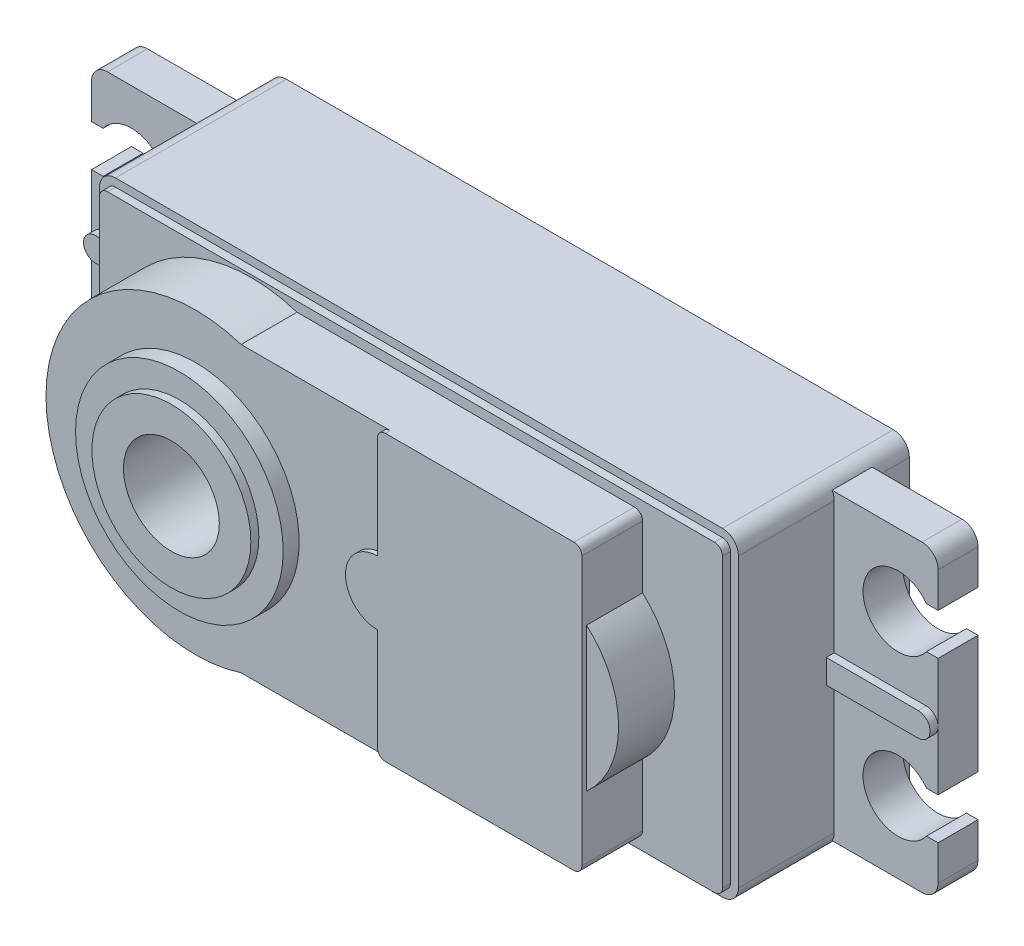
from build123d import *

# Parameters (mm, degrees)
Z_KLAD_PROTA_EN_DEPTH    = 10.7
P_ID_N_PROTA_EN_1_DEPTH  = 0.5
P_ID_N_PROTA_EN_2_DEPTH  = 3.5
P_ID_N_PROTA_EN_3_DEPTH  = 0.3
SKICA5_R                 = 6.5
P_ID_N_PROTA_EN_5_DEPTH  = 1
SKICA6_R                 = 4.975
P_ID_N_PROTA_EN_6_DEPTH  = 0.5
SKICA7_R                 = 3
ODEBR_N_PROTA_EN_1_DEPTH = 28.612316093
P_ID_N_PROTA_EN_7_DEPTH  = 2.5
P_ID_N_PROTA_EN_8_DEPTH  = 0.5


with BuildPart() as part:
    # Skica1 → Z_klad-Prota_en (new body)
    with BuildSketch(Plane.XY):
        with BuildLine():
            Line((-19, -10), (19, -10))
            ThreePointArc((19, -10), (19.707106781, -9.707106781), (20, -9))
            Line((20, -9), (20, 9))
            ThreePointArc((20, 9), (19.707106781, 9.707106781), (19, 10))
            Line((19, 10), (-19, 10))
            ThreePointArc((-19, 10), (-19.707106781, 9.707106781), (-20, 9))
            Line((-20, 9), (-20, -9))
            ThreePointArc((-20, -9), (-19.707106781, -9.707106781), (-19, -10))
        make_face()
    extrude(amount=Z_KLAD_PROTA_EN_DEPTH)

    # Skica2 → P_id_n_-Prota_en_1 (add)
    with BuildSketch(Plane.XY.offset(10.7)):
        with BuildLine():
            Line((-19, -9.5), (19, -9.5))
            ThreePointArc((19, -9.5), (19.353553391, -9.353553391), (19.5, -9))
            Line((19.5, -9), (19.5, 9))
            ThreePointArc((19.5, 9), (19.353553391, 9.353553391), (19, 9.5))
            Line((19, 9.5), (-19, 9.5))
            ThreePointArc((-19, 9.5), (-19.353553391, 9.353553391), (-19.5, 9))
            Line((-19.5, 9), (-19.5, -9))
            ThreePointArc((-19.5, -9), (-19.353553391, -9.353553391), (-19, -9.5))
        make_face()
    extrude(amount=P_ID_N_PROTA_EN_1_DEPTH)

    # Skica3 → P_id_n_-Prota_en_2 (add)
    with BuildSketch(Plane.XY.offset(11.2)):
        with BuildLine():
            Line((-7.134254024, 8.9), (14, 8.9))
            ThreePointArc((14, 8.9), (14.353553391, 8.753553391), (14.5, 8.4))
            Line((14.5, 8.4), (14.5, 4.5))
            ThreePointArc((14.5, 4.5), (16.5, 0), (14.5, -4.5))
            Line((14.5, -4.5), (14.5, -8.4))
            ThreePointArc((14.5, -8.4), (14.353553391, -8.753553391), (14, -8.9))
            Line((14, -8.9), (-7.134254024, -8.9))
            ThreePointArc((-7.134254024, -8.9), (-19.35, 0), (-7.134254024, 8.9))
        make_face()
    extrude(amount=P_ID_N_PROTA_EN_2_DEPTH)

    # Skica4 → P_id_n_-Prota_en_3 (add)
    with BuildSketch(Plane.XY.offset(14.7)):
        with BuildLine():
            Line((1.7, -8.4), (1.7, -2))
            ThreePointArc((1.7, -2), (-0.3, 0), (1.7, 2))
            Line((1.7, 2), (1.7, 8.4))
            ThreePointArc((1.7, 8.4), (1.846446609, 8.753553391), (2.2, 8.9))
            Line((2.2, 8.9), (14, 8.9))
            ThreePointArc((14, 8.9), (14.353553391, 8.753553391), (14.5, 8.4))
            Line((14.5, 8.4), (14.5, -8.4))
            ThreePointArc((14.5, -8.4), (14.353553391, -8.753553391), (14, -8.9))
            Line((14, -8.9), (2.2, -8.9))
            ThreePointArc((2.2, -8.9), (1.846446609, -8.753553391), (1.7, -8.4))
        make_face()
    extrude(amount=P_ID_N_PROTA_EN_3_DEPTH)

    # Skica5 → P_id_n_-Prota_en_5 (add)
    with BuildSketch(Plane.XY.offset(14.7)):
        with Locations(Location((-10, 0, 0), (0, 0, 180))):
            Circle(SKICA5_R)
    extrude(amount=P_ID_N_PROTA_EN_5_DEPTH)

    # Skica6 → P_id_n_-Prota_en_6 (add)
    with BuildSketch(Plane.XY.offset(15.7)):
        with Locations((-10, 0)):
            Circle(SKICA6_R)
    extrude(amount=P_ID_N_PROTA_EN_6_DEPTH)

    # Skica7 → Odebr_n_-Prota_en_1 (cut, through all)
    with BuildSketch(Plane.XY.offset(16.2)):
        with Locations((-10, 0)):
            Circle(SKICA7_R)
    extrude(amount=-ODEBR_N_PROTA_EN_1_DEPTH, mode=Mode.SUBTRACT)

    # Skica8 → P_id_n_-Prota_en_7 (add)
    with BuildSketch(Plane(origin=(0, 0, 2.2), x_dir=(-1, 0, 0), z_dir=(0, 0, -1))):
        with BuildLine():
            Line((19.866025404, 9.5), (25.5, 9.5))
            ThreePointArc((25.5, 9.5), (26.207106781, 9.207106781), (26.5, 8.5))
            Line((26.5, 8.5), (26.5, 6.3))
            Line((26.5, 6.3), (25.774823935, 6.3))
            ThreePointArc((25.774823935, 6.3), (21.8, 5), (25.774823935, 3.7))
            Line((25.774823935, 3.7), (26.5, 3.7))
            Line((26.5, 3.7), (26.5, -3.7))
            Line((26.5, -3.7), (25.774823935, -3.7))
            ThreePointArc((25.774823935, -3.7), (21.8, -5), (25.774823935, -6.3))
            Line((25.774823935, -6.3), (26.5, -6.3))
            Line((26.5, -6.3), (26.5, -8.5))
            ThreePointArc((26.5, -8.5), (26.207106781, -9.207106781), (25.5, -9.5))
            Line((25.5, -9.5), (19.866025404, -9.5))
            Line((19.866025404, -9.5), (19.866025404, 9.5))
        make_face()
    p_id_n_prota_en_7 = extrude(amount=-P_ID_N_PROTA_EN_7_DEPTH)

    # Skica9 → P_id_n_-Prota_en_8 (add)
    with BuildSketch(Plane.XY.offset(4.7)):
        with BuildLine():
            Line((-20, 0.75), (-25.75, 0.75))
            ThreePointArc((-25.75, 0.75), (-26.5, 0), (-25.75, -0.75))
            Line((-25.75, -0.75), (-20, -0.75))
            Line((-20, -0.75), (-20, 0.75))
        make_face()
    p_id_n_prota_en_8 = extrude(amount=P_ID_N_PROTA_EN_8_DEPTH)

    # Zrcadlen_1: P_id_n_-Prota_en_7, P_id_n_-Prota_en_8 across plane
    add(p_id_n_prota_en_7.mirror(Plane(origin=(0, 0, 0), x_dir=(0, 0, 1), z_dir=(1, 0, 0))))
    add(p_id_n_prota_en_8.mirror(Plane(origin=(0, 0, 0), x_dir=(0, 0, 1), z_dir=(1, 0, 0))))


solid = part.part
